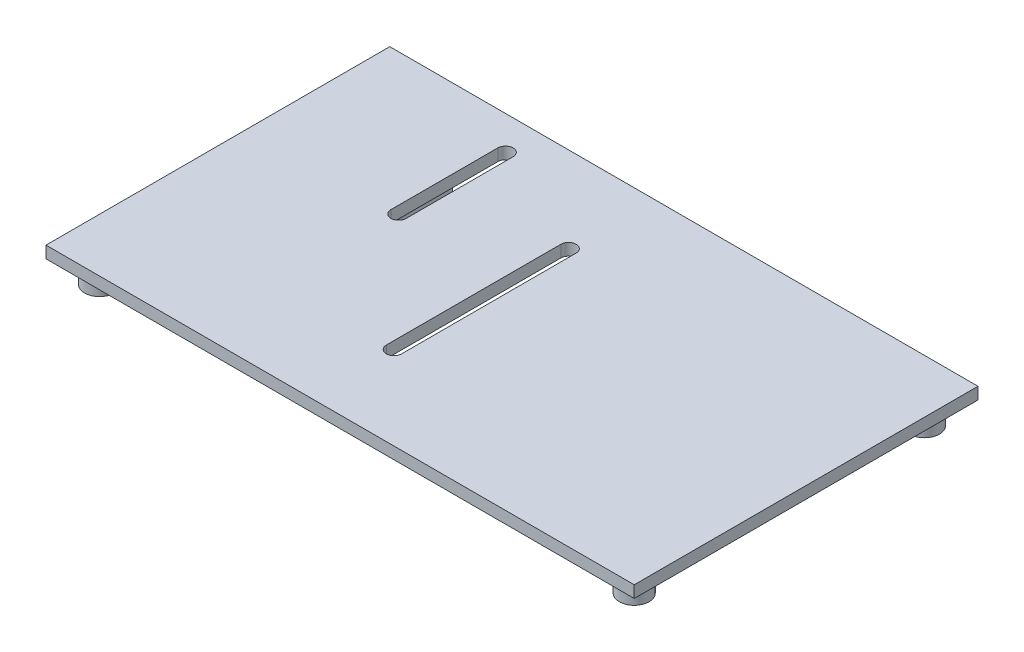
from build123d import *

# Parameters (mm, degrees)
SKETCH1_W                  = 77
SKETCH1_H                  = 45
BASE_EXTRUDE_DEPTH         = 1.56
SKETCH2_R                  = 3
STANDOFF_EXTRUDE_DEPTH     = 0.5
SKETCH3_R                  = 1.95
STANDOFF_EXTRUDE_TWO_DEPTH = 2.4
SKETCH4_W                  = 4.7
SKETCH4_H                  = 25.5
SKETCH4_W_2                = 4.75
SKETCH4_H_2                = 7.05
TOUCH_AND_TFT_ZIF_DEPTH    = 1.25
SKETCH5_W                  = 5.5
SKETCH5_H                  = 19.5
INTERFACE_ZIF_DEPTH        = 2
CUTOUT_CUT_DEPTH           = 45.686798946
F_2_56_TAPPED_HOLE1_D      = 1.778
F_2_56_TAPPED_HOLE1_DEPTH  = 3.5
F_2_56_TAPPED_HOLE1_TIP    = 0.53416509


with BuildPart() as part:
    # Sketch1 → Base Extrude (new body)
    with BuildSketch(Plane(origin=(0, 0, 0), x_dir=(1, 0, 0), z_dir=(0, 1, 0))):
        Rectangle(SKETCH1_W, SKETCH1_H)
    extrude(amount=BASE_EXTRUDE_DEPTH)

    # Sketch2 → Standoff Extrude (add)
    with BuildSketch(Plane.XZ):
        with Locations(Location((-35, 19, 0), (0, 0, 270))):
            Circle(SKETCH2_R)
        with Locations(Location((35, 19, 0), (0, 0, 270))):
            Circle(SKETCH2_R)
        with Locations(Location((-35, -19, 0), (0, 0, 270))):
            Circle(SKETCH2_R)
        with Locations(Location((35, -19, 0), (0, 0, 270))):
            Circle(SKETCH2_R)
    extrude(amount=STANDOFF_EXTRUDE_DEPTH)

    # Sketch3 → Standoff Extrude Two (add)
    with BuildSketch(Plane.XZ.offset(0.5)):
        with Locations(Location((-35, 19, 0), (0, 0, 270))):
            Circle(SKETCH3_R)
        with Locations(Location((-35, -19, 0), (0, 0, 270))):
            Circle(SKETCH3_R)
        with Locations(Location((35, -19, 0), (0, 0, 270))):
            Circle(SKETCH3_R)
        with Locations(Location((35, 19, 0), (0, 0, 270))):
            Circle(SKETCH3_R)
    extrude(amount=STANDOFF_EXTRUDE_TWO_DEPTH)

    # Sketch4 → Touch and TFT ZIF (add)
    with BuildSketch(Plane.XZ):
        with Locations((-22.65, 0.25)):
            Rectangle(SKETCH4_W, SKETCH4_H)
        with Locations((14.625, -16.125)):
            Rectangle(SKETCH4_W_2, SKETCH4_H_2)
    extrude(amount=TOUCH_AND_TFT_ZIF_DEPTH)

    # Sketch5 → Interface ZIF (add)
    with BuildSketch(Plane.XZ):
        with Locations((26.75, 0)):
            Rectangle(SKETCH5_W, SKETCH5_H)
    extrude(amount=INTERFACE_ZIF_DEPTH)

    # Sketch6 → Cutout Cut (cut, through all)
    with BuildSketch(Plane.XZ):
        with BuildLine():
            Line((-17.95, -4.1), (-17.95, -18.1))
            ThreePointArc((-17.95, -18.1), (-18.95, -19.1), (-19.95, -18.1))
            Line((-19.95, -18.1), (-19.95, -4.1))
            ThreePointArc((-19.95, -4.1), (-18.95, -3.1), (-17.95, -4.1))
        make_face()
        with BuildLine():
            Line((-2.9, 11.55), (-2.9, -11.3))
            ThreePointArc((-2.9, -11.3), (-3.9, -12.3), (-4.9, -11.3))
            Line((-4.9, -11.3), (-4.9, 11.55))
            ThreePointArc((-4.9, 11.55), (-3.9, 12.55), (-2.9, 11.55))
        make_face()
    extrude(amount=-CUTOUT_CUT_DEPTH, mode=Mode.SUBTRACT)

    # 2-56 Tapped Hole1
    with Locations(Plane(origin=(0, -2.9, 0), x_dir=(-1, 0, 0), z_dir=(0, -1, 0))):
        with Locations((-35, -19), (-35, 19), (35, 19), (35, -19)):
            Hole(F_2_56_TAPPED_HOLE1_D / 2, depth=F_2_56_TAPPED_HOLE1_DEPTH)
            with Locations((0, 0, -(F_2_56_TAPPED_HOLE1_DEPTH + F_2_56_TAPPED_HOLE1_TIP / 2))):  # 118° drill point
                Cone(0, F_2_56_TAPPED_HOLE1_D / 2, F_2_56_TAPPED_HOLE1_TIP, mode=Mode.SUBTRACT)


solid = part.part
